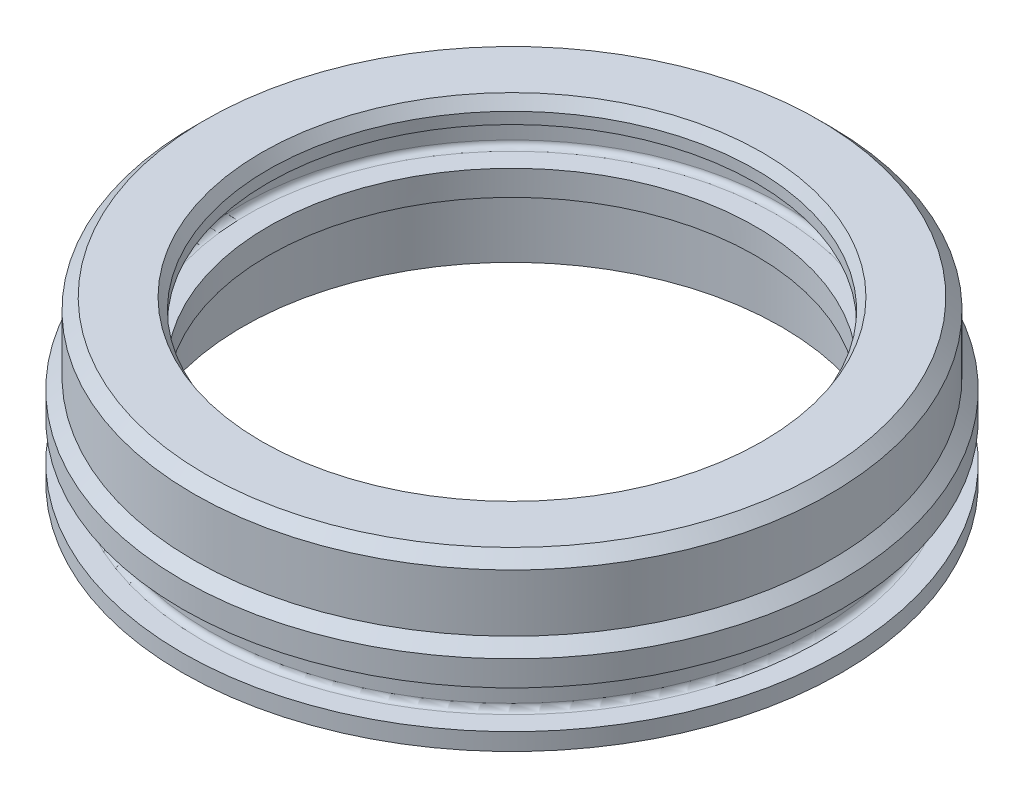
from build123d import *

# Parameters (mm, degrees)
CHANFREIN1_SIZE         = 2
ENL_V_MAT_EXTRU_1_REACH = 88.003
ESQUISSE2_R             = 42.5
ESQUISSE3_R             = 47
ENL_V_MAT_EXTRU_2_DEPTH = 13
CHANFREIN2_SIZE         = 2
CHANFREIN2_SIZE2        = 1.154700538


with BuildPart() as part:
    # Esquisse1 → R_volution1 (revolve)
    with BuildSketch(Plane.XY, mode=Mode.PRIVATE) as r_volution1_sk:
        Polygon((0, 0), (-57.5, 0), (-57.5, 14), (-55.5, 16), (-55.5, 28), (0, 28), align=None)
    revolve(r_volution1_sk.sketch.rotate(Axis((0, 0, 0), (0, -1, 0)), 270), axis=Axis((0, 0, 0), (0, -1, 0)))

    # Chanfrein1
    chanfrein1_edges = [part.edges().sort_by_distance(p)[0] for p in [
        (0, 28, -55.5),
    ]]
    chamfer(chanfrein1_edges, length=CHANFREIN1_SIZE)

    # Esquisse2 → Enl_v. mat.-Extru.1 (cut, up to next)
    with BuildSketch(Plane(origin=(0, 28, 0), x_dir=(-1, 0, 0), z_dir=(0, 1, 0)), mode=Mode.PRIVATE) as enl_v_mat_extru_1_sk1:
        with Locations(Location((0, 0, 0), (0, 0, 90))):
            Circle(ESQUISSE2_R)
    enl_v_mat_extru_1_tool1 = extrude(enl_v_mat_extru_1_sk1.sketch, amount=-ENL_V_MAT_EXTRU_1_REACH, mode=Mode.PRIVATE) & part.part
    add(enl_v_mat_extru_1_tool1.solids().sort_by_distance((0, 28, 0))[0], mode=Mode.SUBTRACT)

    # Esquisse3 → Enl_v. mat.-Extru.2 (cut)
    with BuildSketch(Plane.XZ):
        with Locations(Location((0, 0, 0), (0, 0, 270))):
            Circle(ESQUISSE3_R)
    extrude(amount=-ENL_V_MAT_EXTRU_2_DEPTH, mode=Mode.SUBTRACT)

    # Esquisse4 → Enl_vement de mati_re-R_volution1 (revolve, cut)
    with BuildSketch(Plane.XY, mode=Mode.PRIVATE) as enl_vement_de_mati_re_r_volution1_sk:
        with BuildLine():
            Line((-63.241944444, 9.61), (-53.86, 9.61))
            ThreePointArc((-53.86, 9.61), (-53.152893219, 9.317106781), (-52.86, 8.61))
            Line((-52.86, 8.61), (-52.86, 4))
            ThreePointArc((-52.86, 4), (-53.152893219, 3.292893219), (-53.86, 3))
            Line((-53.86, 3), (-63.241944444, 3))
            Line((-63.241944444, 3), (-63.241944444, 9.61))
        make_face()
    revolve(enl_vement_de_mati_re_r_volution1_sk.sketch.rotate(Axis((0, 0, 0), (0, -1, 0)), 270), axis=Axis((0, 0, 0), (0, -1, 0)), mode=Mode.SUBTRACT)

    # Esquisse5 → Enl_vement de mati_re-R_volution2 (revolve, cut)
    with BuildSketch(Plane.XY, mode=Mode.PRIVATE) as enl_vement_de_mati_re_r_volution2_sk:
        with BuildLine():
            Line((0, 24), (46.14, 24))
            ThreePointArc((46.14, 24), (46.847106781, 23.707106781), (47.14, 23))
            Line((47.14, 23), (47.14, 18.39))
            ThreePointArc((47.14, 18.39), (46.847106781, 17.682893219), (46.14, 17.39))
            Line((46.14, 17.39), (0, 17.39))
            Line((0, 17.39), (0, 24))
        make_face()
    revolve(enl_vement_de_mati_re_r_volution2_sk.sketch.rotate(Axis((0, 0, 0), (0, -1, 0)), 90), axis=Axis((0, 0, 0), (0, -1, 0)), mode=Mode.SUBTRACT)

    # Chanfrein2
    chanfrein2_edges = [part.edges().sort_by_distance(p)[0] for p in [
        (0, 28, -42.5),
    ]]
    chanfrein2_side = [part.faces().sort_by_distance(p)[0] for p in [
        (0, 26, -42.5),
    ]]
    chamfer(chanfrein2_edges, length=CHANFREIN2_SIZE, length2=CHANFREIN2_SIZE2, reference=chanfrein2_side[0])


solid = part.part
